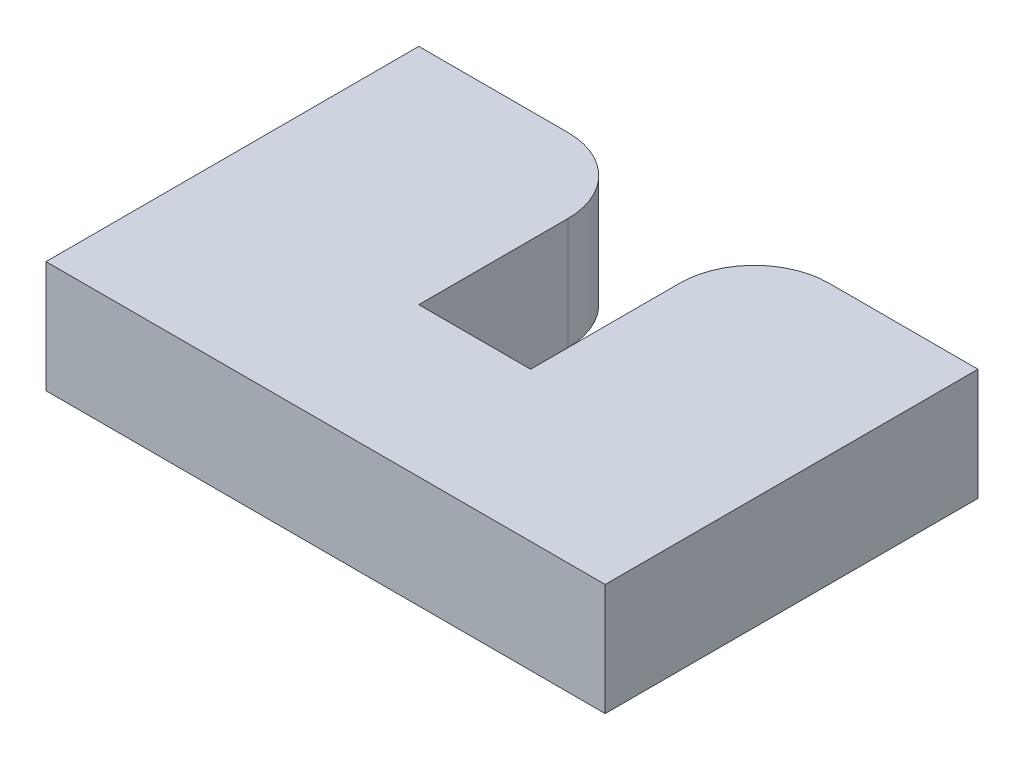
ISO-10303-21;
HEADER;
FILE_DESCRIPTION(('STEP AP214'),'2;1');
FILE_NAME('part.step','',(''),(''),'','','');
FILE_SCHEMA(('AUTOMOTIVE_DESIGN { 1 0 10303 214 1 1 1 1 }'));
ENDSEC;
DATA;
#1=APPLICATION_CONTEXT('core data for automotive mechanical design processes');
#2=APPLICATION_PROTOCOL_DEFINITION('international standard','automotive_design',2000,#1);
#3=PRODUCT_CONTEXT('',#1,'mechanical');
#4=PRODUCT('Part','Part','',(#3));
#5=PRODUCT_RELATED_PRODUCT_CATEGORY('part','',(#4));
#6=PRODUCT_DEFINITION_FORMATION('','',#4);
#7=PRODUCT_DEFINITION_CONTEXT('part definition',#1,'design');
#8=PRODUCT_DEFINITION('design','',#6,#7);
#9=PRODUCT_DEFINITION_SHAPE('','',#8);
#10=(LENGTH_UNIT() NAMED_UNIT(*) SI_UNIT(.MILLI.,.METRE.));
#11=(NAMED_UNIT(*) PLANE_ANGLE_UNIT() SI_UNIT($,.RADIAN.));
#12=(NAMED_UNIT(*) SI_UNIT($,.STERADIAN.) SOLID_ANGLE_UNIT());
#13=UNCERTAINTY_MEASURE_WITH_UNIT(LENGTH_MEASURE(1.E-05),#10,'distance_accuracy_value','');
#14=(GEOMETRIC_REPRESENTATION_CONTEXT(3) GLOBAL_UNCERTAINTY_ASSIGNED_CONTEXT((#13)) GLOBAL_UNIT_ASSIGNED_CONTEXT((#10,
#11,#12)) REPRESENTATION_CONTEXT('',''));
#15=CARTESIAN_POINT('',(0.,0.,0.));
#16=DIRECTION('',(0.,0.,1.));
#17=DIRECTION('',(1.,0.,0.));
#18=AXIS2_PLACEMENT_3D('',#15,#16,#17);
#19=CARTESIAN_POINT('',(0.,15.,0.));
#20=DIRECTION('',(1.,0.,0.));
#21=DIRECTION('',(0.,0.,-1.));
#22=AXIS2_PLACEMENT_3D('',#19,#20,#21);
#23=PLANE('',#22);
#24=DIRECTION('',(0.,0.,1.));
#25=VECTOR('',#24,1.);
#26=CARTESIAN_POINT('',(0.,0.,0.));
#27=LINE('',#26,#25);
#28=CARTESIAN_POINT('',(0.,0.,-50.));
#29=VERTEX_POINT('',#28);
#30=CARTESIAN_POINT('',(0.,0.,0.));
#31=VERTEX_POINT('',#30);
#32=EDGE_CURVE('E143',#29,#31,#27,.T.);
#33=ORIENTED_EDGE('',*,*,#32,.T.);
#34=DIRECTION('',(0.,-1.,0.));
#35=VECTOR('',#34,1.);
#36=CARTESIAN_POINT('',(0.,15.,0.));
#37=LINE('',#36,#35);
#38=CARTESIAN_POINT('',(0.,15.,0.));
#39=VERTEX_POINT('',#38);
#40=EDGE_CURVE('E11',#39,#31,#37,.T.);
#41=ORIENTED_EDGE('',*,*,#40,.F.);
#42=DIRECTION('',(0.,0.,1.));
#43=VECTOR('',#42,1.);
#44=CARTESIAN_POINT('',(0.,15.,0.));
#45=LINE('',#44,#43);
#46=CARTESIAN_POINT('',(0.,15.,-50.));
#47=VERTEX_POINT('',#46);
#48=EDGE_CURVE('E161',#47,#39,#45,.T.);
#49=ORIENTED_EDGE('',*,*,#48,.F.);
#50=DIRECTION('',(0.,-1.,0.));
#51=VECTOR('',#50,1.);
#52=CARTESIAN_POINT('',(0.,15.,-50.));
#53=LINE('',#52,#51);
#54=EDGE_CURVE('E139',#47,#29,#53,.T.);
#55=ORIENTED_EDGE('',*,*,#54,.T.);
#56=EDGE_LOOP('',(#33,#41,#49,#55));
#57=FACE_BOUND('',#56,.T.);
#58=ADVANCED_FACE('F35',(#57),#23,.F.);
#59=CARTESIAN_POINT('',(0.,15.,0.));
#60=DIRECTION('',(0.,0.,-1.));
#61=DIRECTION('',(-1.,0.,0.));
#62=AXIS2_PLACEMENT_3D('',#59,#60,#61);
#63=PLANE('',#62);
#64=DIRECTION('',(1.,0.,0.));
#65=VECTOR('',#64,1.);
#66=CARTESIAN_POINT('',(0.,0.,0.));
#67=LINE('',#66,#65);
#68=CARTESIAN_POINT('',(75.,0.,0.));
#69=VERTEX_POINT('',#68);
#70=EDGE_CURVE('E146',#31,#69,#67,.T.);
#71=ORIENTED_EDGE('',*,*,#70,.T.);
#72=DIRECTION('',(0.,-1.,0.));
#73=VECTOR('',#72,1.);
#74=CARTESIAN_POINT('',(75.,15.,0.));
#75=LINE('',#74,#73);
#76=CARTESIAN_POINT('',(75.,15.,0.));
#77=VERTEX_POINT('',#76);
#78=EDGE_CURVE('E43',#77,#69,#75,.T.);
#79=ORIENTED_EDGE('',*,*,#78,.F.);
#80=DIRECTION('',(1.,0.,0.));
#81=VECTOR('',#80,1.);
#82=CARTESIAN_POINT('',(0.,15.,0.));
#83=LINE('',#82,#81);
#84=EDGE_CURVE('E100',#39,#77,#83,.T.);
#85=ORIENTED_EDGE('',*,*,#84,.F.);
#86=ORIENTED_EDGE('',*,*,#40,.T.);
#87=EDGE_LOOP('',(#71,#79,#85,#86));
#88=FACE_BOUND('',#87,.T.);
#89=ADVANCED_FACE('F210',(#88),#63,.F.);
#90=CARTESIAN_POINT('',(75.,15.,0.));
#91=DIRECTION('',(-1.,0.,0.));
#92=DIRECTION('',(0.,0.,1.));
#93=AXIS2_PLACEMENT_3D('',#90,#91,#92);
#94=PLANE('',#93);
#95=DIRECTION('',(0.,0.,-1.));
#96=VECTOR('',#95,1.);
#97=CARTESIAN_POINT('',(75.,0.,0.));
#98=LINE('',#97,#96);
#99=CARTESIAN_POINT('',(75.,0.,-50.));
#100=VERTEX_POINT('',#99);
#101=EDGE_CURVE('E148',#69,#100,#98,.T.);
#102=ORIENTED_EDGE('',*,*,#101,.T.);
#103=DIRECTION('',(0.,-1.,0.));
#104=VECTOR('',#103,1.);
#105=CARTESIAN_POINT('',(75.,15.,-50.));
#106=LINE('',#105,#104);
#107=CARTESIAN_POINT('',(75.,15.,-50.));
#108=VERTEX_POINT('',#107);
#109=EDGE_CURVE('E174',#108,#100,#106,.T.);
#110=ORIENTED_EDGE('',*,*,#109,.F.);
#111=DIRECTION('',(0.,0.,-1.));
#112=VECTOR('',#111,1.);
#113=CARTESIAN_POINT('',(75.,15.,0.));
#114=LINE('',#113,#112);
#115=EDGE_CURVE('E182',#77,#108,#114,.T.);
#116=ORIENTED_EDGE('',*,*,#115,.F.);
#117=ORIENTED_EDGE('',*,*,#78,.T.);
#118=EDGE_LOOP('',(#102,#110,#116,#117));
#119=FACE_BOUND('',#118,.T.);
#120=ADVANCED_FACE('F180',(#119),#94,.F.);
#121=CARTESIAN_POINT('',(55.0000000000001,15.,-50.));
#122=DIRECTION('',(0.,0.,1.));
#123=DIRECTION('',(1.,0.,0.));
#124=AXIS2_PLACEMENT_3D('',#121,#122,#123);
#125=PLANE('',#124);
#126=DIRECTION('',(-1.,0.,0.));
#127=VECTOR('',#126,1.);
#128=CARTESIAN_POINT('',(55.0000000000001,0.,-50.));
#129=LINE('',#128,#127);
#130=CARTESIAN_POINT('',(55.0000000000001,0.,-50.));
#131=VERTEX_POINT('',#130);
#132=EDGE_CURVE('E150',#100,#131,#129,.T.);
#133=ORIENTED_EDGE('',*,*,#132,.T.);
#134=DIRECTION('',(0.,-1.,0.));
#135=VECTOR('',#134,1.);
#136=CARTESIAN_POINT('',(55.0000000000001,15.,-50.));
#137=LINE('',#136,#135);
#138=CARTESIAN_POINT('',(55.0000000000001,15.,-50.));
#139=VERTEX_POINT('',#138);
#140=EDGE_CURVE('E171',#139,#131,#137,.T.);
#141=ORIENTED_EDGE('',*,*,#140,.F.);
#142=DIRECTION('',(-1.,0.,0.));
#143=VECTOR('',#142,1.);
#144=CARTESIAN_POINT('',(55.0000000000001,15.,-50.));
#145=LINE('',#144,#143);
#146=EDGE_CURVE('E200',#108,#139,#145,.T.);
#147=ORIENTED_EDGE('',*,*,#146,.F.);
#148=ORIENTED_EDGE('',*,*,#109,.T.);
#149=EDGE_LOOP('',(#133,#141,#147,#148));
#150=FACE_BOUND('',#149,.T.);
#151=ADVANCED_FACE('F191',(#150),#125,.F.);
#152=CARTESIAN_POINT('',(55.,15.,-40.));
#153=DIRECTION('',(0.,-1.,0.));
#154=DIRECTION('',(0.,0.,-1.));
#155=AXIS2_PLACEMENT_3D('',#152,#153,#154);
#156=CYLINDRICAL_SURFACE('',#155,10.);
#157=CARTESIAN_POINT('',(55.,0.,-40.));
#158=DIRECTION('',(0.,1.,0.));
#159=DIRECTION('',(0.,0.,-1.));
#160=AXIS2_PLACEMENT_3D('',#157,#158,#159);
#161=CIRCLE('',#160,10.);
#162=CARTESIAN_POINT('',(45.,0.,-39.9999999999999));
#163=VERTEX_POINT('',#162);
#164=EDGE_CURVE('E152',#131,#163,#161,.T.);
#165=ORIENTED_EDGE('',*,*,#164,.T.);
#166=DIRECTION('',(0.,-1.,0.));
#167=VECTOR('',#166,1.);
#168=CARTESIAN_POINT('',(45.,15.,-39.9999999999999));
#169=LINE('',#168,#167);
#170=CARTESIAN_POINT('',(45.,15.,-39.9999999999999));
#171=VERTEX_POINT('',#170);
#172=EDGE_CURVE('E168',#171,#163,#169,.T.);
#173=ORIENTED_EDGE('',*,*,#172,.F.);
#174=CARTESIAN_POINT('',(55.,15.,-40.));
#175=DIRECTION('',(0.,1.,0.));
#176=DIRECTION('',(0.,0.,-1.));
#177=AXIS2_PLACEMENT_3D('',#174,#175,#176);
#178=CIRCLE('',#177,10.);
#179=EDGE_CURVE('E197',#139,#171,#178,.T.);
#180=ORIENTED_EDGE('',*,*,#179,.F.);
#181=ORIENTED_EDGE('',*,*,#140,.T.);
#182=EDGE_LOOP('',(#165,#173,#180,#181));
#183=FACE_BOUND('',#182,.T.);
#184=ADVANCED_FACE('F195',(#183),#156,.T.);
#185=CARTESIAN_POINT('',(45.,15.,-20.));
#186=DIRECTION('',(1.,0.,0.));
#187=DIRECTION('',(0.,0.,-1.));
#188=AXIS2_PLACEMENT_3D('',#185,#186,#187);
#189=PLANE('',#188);
#190=DIRECTION('',(0.,0.,1.));
#191=VECTOR('',#190,1.);
#192=CARTESIAN_POINT('',(45.,0.,-20.));
#193=LINE('',#192,#191);
#194=CARTESIAN_POINT('',(45.,0.,-20.));
#195=VERTEX_POINT('',#194);
#196=EDGE_CURVE('E154',#163,#195,#193,.T.);
#197=ORIENTED_EDGE('',*,*,#196,.T.);
#198=DIRECTION('',(0.,-1.,0.));
#199=VECTOR('',#198,1.);
#200=CARTESIAN_POINT('',(45.,15.,-20.));
#201=LINE('',#200,#199);
#202=CARTESIAN_POINT('',(45.,15.,-20.));
#203=VERTEX_POINT('',#202);
#204=EDGE_CURVE('E165',#203,#195,#201,.T.);
#205=ORIENTED_EDGE('',*,*,#204,.F.);
#206=DIRECTION('',(0.,0.,1.));
#207=VECTOR('',#206,1.);
#208=CARTESIAN_POINT('',(45.,15.,-20.));
#209=LINE('',#208,#207);
#210=EDGE_CURVE('E199',#171,#203,#209,.T.);
#211=ORIENTED_EDGE('',*,*,#210,.F.);
#212=ORIENTED_EDGE('',*,*,#172,.T.);
#213=EDGE_LOOP('',(#197,#205,#211,#212));
#214=FACE_BOUND('',#213,.T.);
#215=ADVANCED_FACE('F222',(#214),#189,.F.);
#216=CARTESIAN_POINT('',(30.,15.,-20.));
#217=DIRECTION('',(0.,0.,1.));
#218=DIRECTION('',(1.,0.,0.));
#219=AXIS2_PLACEMENT_3D('',#216,#217,#218);
#220=PLANE('',#219);
#221=DIRECTION('',(-1.,0.,0.));
#222=VECTOR('',#221,1.);
#223=CARTESIAN_POINT('',(30.,0.,-20.));
#224=LINE('',#223,#222);
#225=CARTESIAN_POINT('',(30.,0.,-20.));
#226=VERTEX_POINT('',#225);
#227=EDGE_CURVE('E156',#195,#226,#224,.T.);
#228=ORIENTED_EDGE('',*,*,#227,.T.);
#229=DIRECTION('',(0.,-1.,0.));
#230=VECTOR('',#229,1.);
#231=CARTESIAN_POINT('',(30.,15.,-20.));
#232=LINE('',#231,#230);
#233=CARTESIAN_POINT('',(30.,15.,-20.));
#234=VERTEX_POINT('',#233);
#235=EDGE_CURVE('E134',#234,#226,#232,.T.);
#236=ORIENTED_EDGE('',*,*,#235,.F.);
#237=DIRECTION('',(-1.,0.,0.));
#238=VECTOR('',#237,1.);
#239=CARTESIAN_POINT('',(30.,15.,-20.));
#240=LINE('',#239,#238);
#241=EDGE_CURVE('E125',#203,#234,#240,.T.);
#242=ORIENTED_EDGE('',*,*,#241,.F.);
#243=ORIENTED_EDGE('',*,*,#204,.T.);
#244=EDGE_LOOP('',(#228,#236,#242,#243));
#245=FACE_BOUND('',#244,.T.);
#246=ADVANCED_FACE('F225',(#245),#220,.F.);
#247=CARTESIAN_POINT('',(30.,15.,-39.9999999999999));
#248=DIRECTION('',(-1.,0.,0.));
#249=DIRECTION('',(0.,0.,1.));
#250=AXIS2_PLACEMENT_3D('',#247,#248,#249);
#251=PLANE('',#250);
#252=DIRECTION('',(0.,0.,-1.));
#253=VECTOR('',#252,1.);
#254=CARTESIAN_POINT('',(30.,0.,-39.9999999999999));
#255=LINE('',#254,#253);
#256=CARTESIAN_POINT('',(30.,0.,-39.9999999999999));
#257=VERTEX_POINT('',#256);
#258=EDGE_CURVE('E133',#226,#257,#255,.T.);
#259=ORIENTED_EDGE('',*,*,#258,.T.);
#260=DIRECTION('',(0.,-1.,0.));
#261=VECTOR('',#260,1.);
#262=CARTESIAN_POINT('',(30.,15.,-39.9999999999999));
#263=LINE('',#262,#261);
#264=CARTESIAN_POINT('',(30.,15.,-39.9999999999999));
#265=VERTEX_POINT('',#264);
#266=EDGE_CURVE('E130',#265,#257,#263,.T.);
#267=ORIENTED_EDGE('',*,*,#266,.F.);
#268=DIRECTION('',(0.,0.,-1.));
#269=VECTOR('',#268,1.);
#270=CARTESIAN_POINT('',(30.,15.,-39.9999999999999));
#271=LINE('',#270,#269);
#272=EDGE_CURVE('E119',#234,#265,#271,.T.);
#273=ORIENTED_EDGE('',*,*,#272,.F.);
#274=ORIENTED_EDGE('',*,*,#235,.T.);
#275=EDGE_LOOP('',(#259,#267,#273,#274));
#276=FACE_BOUND('',#275,.T.);
#277=ADVANCED_FACE('F131',(#276),#251,.F.);
#278=CARTESIAN_POINT('',(20.,15.,-40.));
#279=DIRECTION('',(0.,-1.,0.));
#280=DIRECTION('',(0.,0.,-1.));
#281=AXIS2_PLACEMENT_3D('',#278,#279,#280);
#282=CYLINDRICAL_SURFACE('',#281,10.);
#283=CARTESIAN_POINT('',(20.,0.,-40.));
#284=DIRECTION('',(0.,1.,0.));
#285=DIRECTION('',(0.,0.,1.));
#286=AXIS2_PLACEMENT_3D('',#283,#284,#285);
#287=CIRCLE('',#286,10.);
#288=CARTESIAN_POINT('',(19.9999999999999,0.,-50.));
#289=VERTEX_POINT('',#288);
#290=EDGE_CURVE('E86',#257,#289,#287,.T.);
#291=ORIENTED_EDGE('',*,*,#290,.T.);
#292=DIRECTION('',(0.,-1.,0.));
#293=VECTOR('',#292,1.);
#294=CARTESIAN_POINT('',(19.9999999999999,15.,-50.));
#295=LINE('',#294,#293);
#296=CARTESIAN_POINT('',(19.9999999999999,15.,-50.));
#297=VERTEX_POINT('',#296);
#298=EDGE_CURVE('E135',#297,#289,#295,.T.);
#299=ORIENTED_EDGE('',*,*,#298,.F.);
#300=CARTESIAN_POINT('',(20.,15.,-40.));
#301=DIRECTION('',(0.,1.,0.));
#302=DIRECTION('',(0.,0.,1.));
#303=AXIS2_PLACEMENT_3D('',#300,#301,#302);
#304=CIRCLE('',#303,10.);
#305=EDGE_CURVE('E123',#265,#297,#304,.T.);
#306=ORIENTED_EDGE('',*,*,#305,.F.);
#307=ORIENTED_EDGE('',*,*,#266,.T.);
#308=EDGE_LOOP('',(#291,#299,#306,#307));
#309=FACE_BOUND('',#308,.T.);
#310=ADVANCED_FACE('F137',(#309),#282,.T.);
#311=CARTESIAN_POINT('',(0.,15.,-50.));
#312=DIRECTION('',(0.,0.,1.));
#313=DIRECTION('',(1.,0.,0.));
#314=AXIS2_PLACEMENT_3D('',#311,#312,#313);
#315=PLANE('',#314);
#316=DIRECTION('',(-1.,0.,0.));
#317=VECTOR('',#316,1.);
#318=CARTESIAN_POINT('',(0.,0.,-50.));
#319=LINE('',#318,#317);
#320=EDGE_CURVE('E92',#289,#29,#319,.T.);
#321=ORIENTED_EDGE('',*,*,#320,.T.);
#322=ORIENTED_EDGE('',*,*,#54,.F.);
#323=DIRECTION('',(-1.,0.,0.));
#324=VECTOR('',#323,1.);
#325=CARTESIAN_POINT('',(0.,15.,-50.));
#326=LINE('',#325,#324);
#327=EDGE_CURVE('E51',#297,#47,#326,.T.);
#328=ORIENTED_EDGE('',*,*,#327,.F.);
#329=ORIENTED_EDGE('',*,*,#298,.T.);
#330=EDGE_LOOP('',(#321,#322,#328,#329));
#331=FACE_BOUND('',#330,.T.);
#332=ADVANCED_FACE('F234',(#331),#315,.F.);
#333=CARTESIAN_POINT('',(20.,15.,-40.));
#334=DIRECTION('',(0.,1.,0.));
#335=DIRECTION('',(0.,0.,1.));
#336=AXIS2_PLACEMENT_3D('',#333,#334,#335);
#337=PLANE('',#336);
#338=ORIENTED_EDGE('',*,*,#48,.T.);
#339=ORIENTED_EDGE('',*,*,#84,.T.);
#340=ORIENTED_EDGE('',*,*,#115,.T.);
#341=ORIENTED_EDGE('',*,*,#146,.T.);
#342=ORIENTED_EDGE('',*,*,#179,.T.);
#343=ORIENTED_EDGE('',*,*,#210,.T.);
#344=ORIENTED_EDGE('',*,*,#241,.T.);
#345=ORIENTED_EDGE('',*,*,#272,.T.);
#346=ORIENTED_EDGE('',*,*,#305,.T.);
#347=ORIENTED_EDGE('',*,*,#327,.T.);
#348=EDGE_LOOP('',(#338,#339,#340,#341,#342,#343,#344,#345,#346,#347));
#349=FACE_BOUND('',#348,.T.);
#350=ADVANCED_FACE('F121',(#349),#337,.T.);
#351=CARTESIAN_POINT('',(20.,0.,-40.));
#352=DIRECTION('',(0.,1.,0.));
#353=DIRECTION('',(0.,0.,1.));
#354=AXIS2_PLACEMENT_3D('',#351,#352,#353);
#355=PLANE('',#354);
#356=ORIENTED_EDGE('',*,*,#32,.F.);
#357=ORIENTED_EDGE('',*,*,#320,.F.);
#358=ORIENTED_EDGE('',*,*,#290,.F.);
#359=ORIENTED_EDGE('',*,*,#258,.F.);
#360=ORIENTED_EDGE('',*,*,#227,.F.);
#361=ORIENTED_EDGE('',*,*,#196,.F.);
#362=ORIENTED_EDGE('',*,*,#164,.F.);
#363=ORIENTED_EDGE('',*,*,#132,.F.);
#364=ORIENTED_EDGE('',*,*,#101,.F.);
#365=ORIENTED_EDGE('',*,*,#70,.F.);
#366=EDGE_LOOP('',(#356,#357,#358,#359,#360,#361,#362,#363,#364,#365));
#367=FACE_BOUND('',#366,.T.);
#368=ADVANCED_FACE('F186',(#367),#355,.F.);
#369=CLOSED_SHELL('',(#58,#89,#120,#151,#184,#215,#246,#277,#310,#332,#350,#368));
#370=MANIFOLD_SOLID_BREP('B2',#369);
#371=ADVANCED_BREP_SHAPE_REPRESENTATION('',(#18,#370),#14);
#372=SHAPE_DEFINITION_REPRESENTATION(#9,#371);
ENDSEC;
END-ISO-10303-21;
